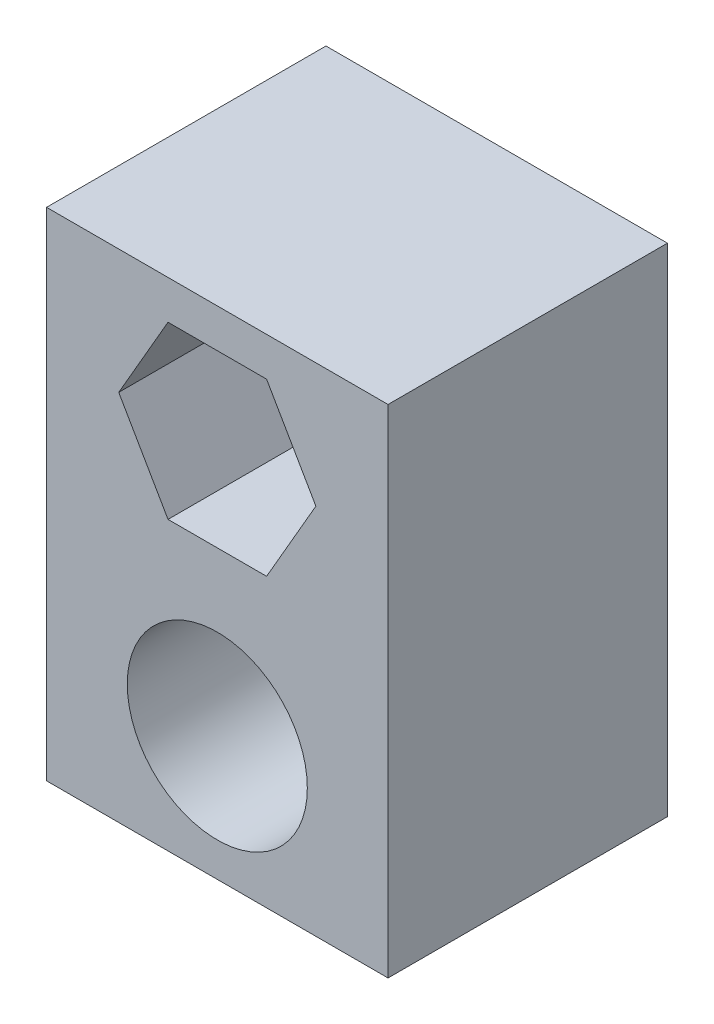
ISO-10303-21;
HEADER;
FILE_DESCRIPTION(('STEP AP214'),'2;1');
FILE_NAME('part.step','',(''),(''),'','','');
FILE_SCHEMA(('AUTOMOTIVE_DESIGN { 1 0 10303 214 1 1 1 1 }'));
ENDSEC;
DATA;
#1=APPLICATION_CONTEXT('core data for automotive mechanical design processes');
#2=APPLICATION_PROTOCOL_DEFINITION('international standard','automotive_design',2000,#1);
#3=PRODUCT_CONTEXT('',#1,'mechanical');
#4=PRODUCT('Part','Part','',(#3));
#5=PRODUCT_RELATED_PRODUCT_CATEGORY('part','',(#4));
#6=PRODUCT_DEFINITION_FORMATION('','',#4);
#7=PRODUCT_DEFINITION_CONTEXT('part definition',#1,'design');
#8=PRODUCT_DEFINITION('design','',#6,#7);
#9=PRODUCT_DEFINITION_SHAPE('','',#8);
#10=(LENGTH_UNIT() NAMED_UNIT(*) SI_UNIT(.MILLI.,.METRE.));
#11=(NAMED_UNIT(*) PLANE_ANGLE_UNIT() SI_UNIT($,.RADIAN.));
#12=(NAMED_UNIT(*) SI_UNIT($,.STERADIAN.) SOLID_ANGLE_UNIT());
#13=UNCERTAINTY_MEASURE_WITH_UNIT(LENGTH_MEASURE(1.E-05),#10,'distance_accuracy_value','');
#14=(GEOMETRIC_REPRESENTATION_CONTEXT(3) GLOBAL_UNCERTAINTY_ASSIGNED_CONTEXT((#13)) GLOBAL_UNIT_ASSIGNED_CONTEXT((#10,
#11,#12)) REPRESENTATION_CONTEXT('',''));
#15=CARTESIAN_POINT('',(0.,0.,0.));
#16=DIRECTION('',(0.,0.,1.));
#17=DIRECTION('',(1.,0.,0.));
#18=AXIS2_PLACEMENT_3D('',#15,#16,#17);
#19=CARTESIAN_POINT('',(0.,0.,9.));
#20=DIRECTION('',(1.,0.,0.));
#21=DIRECTION('',(0.,1.,0.));
#22=AXIS2_PLACEMENT_3D('',#19,#20,#21);
#23=PLANE('',#22);
#24=DIRECTION('',(0.,-1.,0.));
#25=VECTOR('',#24,1.);
#26=CARTESIAN_POINT('',(0.,0.,0.));
#27=LINE('',#26,#25);
#28=CARTESIAN_POINT('',(0.,0.,0.));
#29=VERTEX_POINT('',#28);
#30=CARTESIAN_POINT('',(0.,-16.,0.));
#31=VERTEX_POINT('',#30);
#32=EDGE_CURVE('E179',#29,#31,#27,.T.);
#33=ORIENTED_EDGE('',*,*,#32,.T.);
#34=DIRECTION('',(0.,0.,-1.));
#35=VECTOR('',#34,1.);
#36=CARTESIAN_POINT('',(0.,-16.,9.));
#37=LINE('',#36,#35);
#38=CARTESIAN_POINT('',(0.,-16.,9.));
#39=VERTEX_POINT('',#38);
#40=EDGE_CURVE('E11',#39,#31,#37,.T.);
#41=ORIENTED_EDGE('',*,*,#40,.F.);
#42=DIRECTION('',(0.,-1.,0.));
#43=VECTOR('',#42,1.);
#44=CARTESIAN_POINT('',(0.,0.,9.));
#45=LINE('',#44,#43);
#46=CARTESIAN_POINT('',(0.,0.,9.));
#47=VERTEX_POINT('',#46);
#48=EDGE_CURVE('E192',#47,#39,#45,.T.);
#49=ORIENTED_EDGE('',*,*,#48,.F.);
#50=DIRECTION('',(0.,0.,-1.));
#51=VECTOR('',#50,1.);
#52=CARTESIAN_POINT('',(0.,0.,9.));
#53=LINE('',#52,#51);
#54=EDGE_CURVE('E198',#47,#29,#53,.T.);
#55=ORIENTED_EDGE('',*,*,#54,.T.);
#56=EDGE_LOOP('',(#33,#41,#49,#55));
#57=FACE_BOUND('',#56,.T.);
#58=ADVANCED_FACE('F41',(#57),#23,.F.);
#59=CARTESIAN_POINT('',(0.,-16.,9.));
#60=DIRECTION('',(0.,1.,0.));
#61=DIRECTION('',(0.,0.,1.));
#62=AXIS2_PLACEMENT_3D('',#59,#60,#61);
#63=PLANE('',#62);
#64=DIRECTION('',(1.,0.,0.));
#65=VECTOR('',#64,1.);
#66=CARTESIAN_POINT('',(0.,-16.,0.));
#67=LINE('',#66,#65);
#68=CARTESIAN_POINT('',(11.,-16.,0.));
#69=VERTEX_POINT('',#68);
#70=EDGE_CURVE('E201',#31,#69,#67,.T.);
#71=ORIENTED_EDGE('',*,*,#70,.T.);
#72=DIRECTION('',(0.,0.,-1.));
#73=VECTOR('',#72,1.);
#74=CARTESIAN_POINT('',(11.,-16.,9.));
#75=LINE('',#74,#73);
#76=CARTESIAN_POINT('',(11.,-16.,9.));
#77=VERTEX_POINT('',#76);
#78=EDGE_CURVE('E49',#77,#69,#75,.T.);
#79=ORIENTED_EDGE('',*,*,#78,.F.);
#80=DIRECTION('',(1.,0.,0.));
#81=VECTOR('',#80,1.);
#82=CARTESIAN_POINT('',(0.,-16.,9.));
#83=LINE('',#82,#81);
#84=EDGE_CURVE('E94',#39,#77,#83,.T.);
#85=ORIENTED_EDGE('',*,*,#84,.F.);
#86=ORIENTED_EDGE('',*,*,#40,.T.);
#87=EDGE_LOOP('',(#71,#79,#85,#86));
#88=FACE_BOUND('',#87,.T.);
#89=ADVANCED_FACE('F238',(#88),#63,.F.);
#90=CARTESIAN_POINT('',(11.,0.,9.));
#91=DIRECTION('',(-1.,0.,0.));
#92=DIRECTION('',(0.,-1.,0.));
#93=AXIS2_PLACEMENT_3D('',#90,#91,#92);
#94=PLANE('',#93);
#95=DIRECTION('',(0.,1.,0.));
#96=VECTOR('',#95,1.);
#97=CARTESIAN_POINT('',(11.,0.,0.));
#98=LINE('',#97,#96);
#99=CARTESIAN_POINT('',(11.,0.,0.));
#100=VERTEX_POINT('',#99);
#101=EDGE_CURVE('E203',#69,#100,#98,.T.);
#102=ORIENTED_EDGE('',*,*,#101,.T.);
#103=DIRECTION('',(0.,0.,-1.));
#104=VECTOR('',#103,1.);
#105=CARTESIAN_POINT('',(11.,0.,9.));
#106=LINE('',#105,#104);
#107=CARTESIAN_POINT('',(11.,0.,9.));
#108=VERTEX_POINT('',#107);
#109=EDGE_CURVE('E207',#108,#100,#106,.T.);
#110=ORIENTED_EDGE('',*,*,#109,.F.);
#111=DIRECTION('',(0.,1.,0.));
#112=VECTOR('',#111,1.);
#113=CARTESIAN_POINT('',(11.,0.,9.));
#114=LINE('',#113,#112);
#115=EDGE_CURVE('E195',#77,#108,#114,.T.);
#116=ORIENTED_EDGE('',*,*,#115,.F.);
#117=ORIENTED_EDGE('',*,*,#78,.T.);
#118=EDGE_LOOP('',(#102,#110,#116,#117));
#119=FACE_BOUND('',#118,.T.);
#120=ADVANCED_FACE('F243',(#119),#94,.F.);
#121=CARTESIAN_POINT('',(0.,0.,9.));
#122=DIRECTION('',(0.,-1.,0.));
#123=DIRECTION('',(0.,0.,-1.));
#124=AXIS2_PLACEMENT_3D('',#121,#122,#123);
#125=PLANE('',#124);
#126=DIRECTION('',(-1.,0.,0.));
#127=VECTOR('',#126,1.);
#128=CARTESIAN_POINT('',(0.,0.,0.));
#129=LINE('',#128,#127);
#130=EDGE_CURVE('E87',#100,#29,#129,.T.);
#131=ORIENTED_EDGE('',*,*,#130,.T.);
#132=ORIENTED_EDGE('',*,*,#54,.F.);
#133=DIRECTION('',(-1.,0.,0.));
#134=VECTOR('',#133,1.);
#135=CARTESIAN_POINT('',(0.,0.,9.));
#136=LINE('',#135,#134);
#137=EDGE_CURVE('E66',#108,#47,#136,.T.);
#138=ORIENTED_EDGE('',*,*,#137,.F.);
#139=ORIENTED_EDGE('',*,*,#109,.T.);
#140=EDGE_LOOP('',(#131,#132,#138,#139));
#141=FACE_BOUND('',#140,.T.);
#142=ADVANCED_FACE('F253',(#141),#125,.F.);
#143=CARTESIAN_POINT('',(0.,0.,9.));
#144=DIRECTION('',(0.,0.,1.));
#145=DIRECTION('',(1.,0.,0.));
#146=AXIS2_PLACEMENT_3D('',#143,#144,#145);
#147=PLANE('',#146);
#148=DIRECTION('',(0.5,0.866025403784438,0.));
#149=VECTOR('',#148,1.);
#150=CARTESIAN_POINT('',(7.08771324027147,-6.74999999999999,9.));
#151=LINE('',#150,#149);
#152=CARTESIAN_POINT('',(7.08771324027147,-6.74999999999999,9.));
#153=VERTEX_POINT('',#152);
#154=CARTESIAN_POINT('',(8.67542648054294,-4.,9.));
#155=VERTEX_POINT('',#154);
#156=EDGE_CURVE('E57',#153,#155,#151,.T.);
#157=ORIENTED_EDGE('',*,*,#156,.F.);
#158=DIRECTION('',(1.,0.,0.));
#159=VECTOR('',#158,1.);
#160=CARTESIAN_POINT('',(3.91228675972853,-6.75,9.));
#161=LINE('',#160,#159);
#162=CARTESIAN_POINT('',(3.91228675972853,-6.75,9.));
#163=VERTEX_POINT('',#162);
#164=EDGE_CURVE('E149',#163,#153,#161,.T.);
#165=ORIENTED_EDGE('',*,*,#164,.F.);
#166=DIRECTION('',(0.5,-0.866025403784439,0.));
#167=VECTOR('',#166,1.);
#168=CARTESIAN_POINT('',(2.32457351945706,-4.,9.));
#169=LINE('',#168,#167);
#170=CARTESIAN_POINT('',(2.32457351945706,-4.,9.));
#171=VERTEX_POINT('',#170);
#172=EDGE_CURVE('E152',#171,#163,#169,.T.);
#173=ORIENTED_EDGE('',*,*,#172,.F.);
#174=DIRECTION('',(-0.5,-0.866025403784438,0.));
#175=VECTOR('',#174,1.);
#176=CARTESIAN_POINT('',(3.91228675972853,-1.25,9.));
#177=LINE('',#176,#175);
#178=CARTESIAN_POINT('',(3.91228675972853,-1.25,9.));
#179=VERTEX_POINT('',#178);
#180=EDGE_CURVE('E172',#179,#171,#177,.T.);
#181=ORIENTED_EDGE('',*,*,#180,.F.);
#182=DIRECTION('',(-1.,0.,0.));
#183=VECTOR('',#182,1.);
#184=CARTESIAN_POINT('',(7.08771324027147,-1.25,9.));
#185=LINE('',#184,#183);
#186=CARTESIAN_POINT('',(7.08771324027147,-1.25,9.));
#187=VERTEX_POINT('',#186);
#188=EDGE_CURVE('E169',#187,#179,#185,.T.);
#189=ORIENTED_EDGE('',*,*,#188,.F.);
#190=DIRECTION('',(-0.5,0.866025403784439,0.));
#191=VECTOR('',#190,1.);
#192=CARTESIAN_POINT('',(8.67542648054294,-4.,9.));
#193=LINE('',#192,#191);
#194=EDGE_CURVE('E166',#155,#187,#193,.T.);
#195=ORIENTED_EDGE('',*,*,#194,.F.);
#196=EDGE_LOOP('',(#157,#165,#173,#181,#189,#195));
#197=FACE_BOUND('',#196,.T.);
#198=CARTESIAN_POINT('',(5.5,-12.,9.));
#199=DIRECTION('',(0.,0.,1.));
#200=DIRECTION('',(1.,0.,0.));
#201=AXIS2_PLACEMENT_3D('',#198,#199,#200);
#202=CIRCLE('',#201,2.9);
#203=CARTESIAN_POINT('',(8.4,-12.,9.));
#204=VERTEX_POINT('',#203);
#205=EDGE_CURVE('E167',#204,#204,#202,.T.);
#206=ORIENTED_EDGE('',*,*,#205,.F.);
#207=EDGE_LOOP('',(#206));
#208=FACE_BOUND('',#207,.T.);
#209=ORIENTED_EDGE('',*,*,#48,.T.);
#210=ORIENTED_EDGE('',*,*,#84,.T.);
#211=ORIENTED_EDGE('',*,*,#115,.T.);
#212=ORIENTED_EDGE('',*,*,#137,.T.);
#213=EDGE_LOOP('',(#209,#210,#211,#212));
#214=FACE_BOUND('',#213,.T.);
#215=ADVANCED_FACE('F251',(#197,#208,#214),#147,.T.);
#216=CARTESIAN_POINT('',(0.,0.,0.));
#217=DIRECTION('',(0.,0.,1.));
#218=DIRECTION('',(1.,0.,0.));
#219=AXIS2_PLACEMENT_3D('',#216,#217,#218);
#220=PLANE('',#219);
#221=CARTESIAN_POINT('',(5.5,-12.,0.));
#222=DIRECTION('',(0.,0.,1.));
#223=DIRECTION('',(1.,0.,0.));
#224=AXIS2_PLACEMENT_3D('',#221,#222,#223);
#225=CIRCLE('',#224,1.6);
#226=CARTESIAN_POINT('',(7.1,-12.,0.));
#227=VERTEX_POINT('',#226);
#228=EDGE_CURVE('E212',#227,#227,#225,.T.);
#229=ORIENTED_EDGE('',*,*,#228,.T.);
#230=EDGE_LOOP('',(#229));
#231=FACE_BOUND('',#230,.T.);
#232=CARTESIAN_POINT('',(5.49999999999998,-4.,0.));
#233=DIRECTION('',(0.,0.,1.));
#234=DIRECTION('',(1.,0.,0.));
#235=AXIS2_PLACEMENT_3D('',#232,#233,#234);
#236=CIRCLE('',#235,1.6);
#237=CARTESIAN_POINT('',(7.09999999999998,-4.,0.));
#238=VERTEX_POINT('',#237);
#239=EDGE_CURVE('E155',#238,#238,#236,.T.);
#240=ORIENTED_EDGE('',*,*,#239,.T.);
#241=EDGE_LOOP('',(#240));
#242=FACE_BOUND('',#241,.T.);
#243=ORIENTED_EDGE('',*,*,#32,.F.);
#244=ORIENTED_EDGE('',*,*,#130,.F.);
#245=ORIENTED_EDGE('',*,*,#101,.F.);
#246=ORIENTED_EDGE('',*,*,#70,.F.);
#247=EDGE_LOOP('',(#243,#244,#245,#246));
#248=FACE_BOUND('',#247,.T.);
#249=ADVANCED_FACE('F222',(#231,#242,#248),#220,.F.);
#250=CARTESIAN_POINT('',(5.5,-12.,4.));
#251=DIRECTION('',(0.,0.,1.));
#252=DIRECTION('',(1.,0.,0.));
#253=AXIS2_PLACEMENT_3D('',#250,#251,#252);
#254=CYLINDRICAL_SURFACE('',#253,2.9);
#255=CARTESIAN_POINT('',(5.5,-12.,4.));
#256=DIRECTION('',(0.,0.,1.));
#257=DIRECTION('',(1.,0.,0.));
#258=AXIS2_PLACEMENT_3D('',#255,#256,#257);
#259=CIRCLE('',#258,2.9);
#260=CARTESIAN_POINT('',(8.4,-12.,4.));
#261=VERTEX_POINT('',#260);
#262=EDGE_CURVE('E189',#261,#261,#259,.T.);
#263=ORIENTED_EDGE('',*,*,#262,.F.);
#264=EDGE_LOOP('',(#263));
#265=FACE_BOUND('',#264,.T.);
#266=ORIENTED_EDGE('',*,*,#205,.T.);
#267=EDGE_LOOP('',(#266));
#268=FACE_BOUND('',#267,.T.);
#269=ADVANCED_FACE('F261',(#265,#268),#254,.F.);
#270=CARTESIAN_POINT('',(5.5,-12.,4.));
#271=DIRECTION('',(0.,0.,1.));
#272=DIRECTION('',(1.,0.,0.));
#273=AXIS2_PLACEMENT_3D('',#270,#271,#272);
#274=PLANE('',#273);
#275=CARTESIAN_POINT('',(5.5,-12.,4.));
#276=DIRECTION('',(0.,0.,1.));
#277=DIRECTION('',(1.,0.,0.));
#278=AXIS2_PLACEMENT_3D('',#275,#276,#277);
#279=CIRCLE('',#278,1.6);
#280=CARTESIAN_POINT('',(7.1,-12.,4.));
#281=VERTEX_POINT('',#280);
#282=EDGE_CURVE('E44',#281,#281,#279,.T.);
#283=ORIENTED_EDGE('',*,*,#282,.F.);
#284=EDGE_LOOP('',(#283));
#285=FACE_BOUND('',#284,.T.);
#286=ORIENTED_EDGE('',*,*,#262,.T.);
#287=EDGE_LOOP('',(#286));
#288=FACE_BOUND('',#287,.T.);
#289=ADVANCED_FACE('F266',(#285,#288),#274,.T.);
#290=CARTESIAN_POINT('',(7.08771324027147,-6.74999999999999,4.));
#291=DIRECTION('',(0.866025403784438,-0.5,0.));
#292=DIRECTION('',(0.5,0.866025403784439,0.));
#293=AXIS2_PLACEMENT_3D('',#290,#291,#292);
#294=PLANE('',#293);
#295=ORIENTED_EDGE('',*,*,#156,.T.);
#296=DIRECTION('',(0.,0.,1.));
#297=VECTOR('',#296,1.);
#298=CARTESIAN_POINT('',(8.67542648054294,-4.,4.));
#299=LINE('',#298,#297);
#300=CARTESIAN_POINT('',(8.67542648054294,-4.,4.));
#301=VERTEX_POINT('',#300);
#302=EDGE_CURVE('E126',#301,#155,#299,.T.);
#303=ORIENTED_EDGE('',*,*,#302,.F.);
#304=DIRECTION('',(0.5,0.866025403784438,0.));
#305=VECTOR('',#304,1.);
#306=CARTESIAN_POINT('',(7.08771324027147,-6.74999999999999,4.));
#307=LINE('',#306,#305);
#308=CARTESIAN_POINT('',(7.08771324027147,-6.74999999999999,4.));
#309=VERTEX_POINT('',#308);
#310=EDGE_CURVE('E130',#309,#301,#307,.T.);
#311=ORIENTED_EDGE('',*,*,#310,.F.);
#312=DIRECTION('',(0.,0.,1.));
#313=VECTOR('',#312,1.);
#314=CARTESIAN_POINT('',(7.08771324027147,-6.74999999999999,4.));
#315=LINE('',#314,#313);
#316=EDGE_CURVE('E177',#309,#153,#315,.T.);
#317=ORIENTED_EDGE('',*,*,#316,.T.);
#318=EDGE_LOOP('',(#295,#303,#311,#317));
#319=FACE_BOUND('',#318,.T.);
#320=ADVANCED_FACE('F128',(#319),#294,.F.);
#321=CARTESIAN_POINT('',(3.91228675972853,-6.75,4.));
#322=DIRECTION('',(0.,-1.,0.));
#323=DIRECTION('',(1.,0.,0.));
#324=AXIS2_PLACEMENT_3D('',#321,#322,#323);
#325=PLANE('',#324);
#326=ORIENTED_EDGE('',*,*,#164,.T.);
#327=ORIENTED_EDGE('',*,*,#316,.F.);
#328=DIRECTION('',(1.,0.,0.));
#329=VECTOR('',#328,1.);
#330=CARTESIAN_POINT('',(3.91228675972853,-6.75,4.));
#331=LINE('',#330,#329);
#332=CARTESIAN_POINT('',(3.91228675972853,-6.75,4.));
#333=VERTEX_POINT('',#332);
#334=EDGE_CURVE('E136',#333,#309,#331,.T.);
#335=ORIENTED_EDGE('',*,*,#334,.F.);
#336=DIRECTION('',(0.,0.,1.));
#337=VECTOR('',#336,1.);
#338=CARTESIAN_POINT('',(3.91228675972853,-6.75,4.));
#339=LINE('',#338,#337);
#340=EDGE_CURVE('E180',#333,#163,#339,.T.);
#341=ORIENTED_EDGE('',*,*,#340,.T.);
#342=EDGE_LOOP('',(#326,#327,#335,#341));
#343=FACE_BOUND('',#342,.T.);
#344=ADVANCED_FACE('F315',(#343),#325,.F.);
#345=CARTESIAN_POINT('',(2.32457351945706,-4.,4.));
#346=DIRECTION('',(-0.866025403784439,-0.5,0.));
#347=DIRECTION('',(0.5,-0.866025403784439,0.));
#348=AXIS2_PLACEMENT_3D('',#345,#346,#347);
#349=PLANE('',#348);
#350=ORIENTED_EDGE('',*,*,#172,.T.);
#351=ORIENTED_EDGE('',*,*,#340,.F.);
#352=DIRECTION('',(0.5,-0.866025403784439,0.));
#353=VECTOR('',#352,1.);
#354=CARTESIAN_POINT('',(2.32457351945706,-4.,4.));
#355=LINE('',#354,#353);
#356=CARTESIAN_POINT('',(2.32457351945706,-4.,4.));
#357=VERTEX_POINT('',#356);
#358=EDGE_CURVE('E162',#357,#333,#355,.T.);
#359=ORIENTED_EDGE('',*,*,#358,.F.);
#360=DIRECTION('',(0.,0.,1.));
#361=VECTOR('',#360,1.);
#362=CARTESIAN_POINT('',(2.32457351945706,-4.,4.));
#363=LINE('',#362,#361);
#364=EDGE_CURVE('E182',#357,#171,#363,.T.);
#365=ORIENTED_EDGE('',*,*,#364,.T.);
#366=EDGE_LOOP('',(#350,#351,#359,#365));
#367=FACE_BOUND('',#366,.T.);
#368=ADVANCED_FACE('F324',(#367),#349,.F.);
#369=CARTESIAN_POINT('',(3.91228675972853,-1.25,4.));
#370=DIRECTION('',(-0.866025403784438,0.5,0.));
#371=DIRECTION('',(-0.5,-0.866025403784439,0.));
#372=AXIS2_PLACEMENT_3D('',#369,#370,#371);
#373=PLANE('',#372);
#374=ORIENTED_EDGE('',*,*,#180,.T.);
#375=ORIENTED_EDGE('',*,*,#364,.F.);
#376=DIRECTION('',(-0.5,-0.866025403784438,0.));
#377=VECTOR('',#376,1.);
#378=CARTESIAN_POINT('',(3.91228675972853,-1.25,4.));
#379=LINE('',#378,#377);
#380=CARTESIAN_POINT('',(3.91228675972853,-1.25,4.));
#381=VERTEX_POINT('',#380);
#382=EDGE_CURVE('E159',#381,#357,#379,.T.);
#383=ORIENTED_EDGE('',*,*,#382,.F.);
#384=DIRECTION('',(0.,0.,1.));
#385=VECTOR('',#384,1.);
#386=CARTESIAN_POINT('',(3.91228675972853,-1.25,4.));
#387=LINE('',#386,#385);
#388=EDGE_CURVE('E184',#381,#179,#387,.T.);
#389=ORIENTED_EDGE('',*,*,#388,.T.);
#390=EDGE_LOOP('',(#374,#375,#383,#389));
#391=FACE_BOUND('',#390,.T.);
#392=ADVANCED_FACE('F334',(#391),#373,.F.);
#393=CARTESIAN_POINT('',(7.08771324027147,-1.25,4.));
#394=DIRECTION('',(0.,1.,0.));
#395=DIRECTION('',(0.,0.,1.));
#396=AXIS2_PLACEMENT_3D('',#393,#394,#395);
#397=PLANE('',#396);
#398=ORIENTED_EDGE('',*,*,#188,.T.);
#399=ORIENTED_EDGE('',*,*,#388,.F.);
#400=DIRECTION('',(-1.,0.,0.));
#401=VECTOR('',#400,1.);
#402=CARTESIAN_POINT('',(7.08771324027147,-1.25,4.));
#403=LINE('',#402,#401);
#404=CARTESIAN_POINT('',(7.08771324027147,-1.25,4.));
#405=VERTEX_POINT('',#404);
#406=EDGE_CURVE('E144',#405,#381,#403,.T.);
#407=ORIENTED_EDGE('',*,*,#406,.F.);
#408=DIRECTION('',(0.,0.,1.));
#409=VECTOR('',#408,1.);
#410=CARTESIAN_POINT('',(7.08771324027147,-1.25,4.));
#411=LINE('',#410,#409);
#412=EDGE_CURVE('E135',#405,#187,#411,.T.);
#413=ORIENTED_EDGE('',*,*,#412,.T.);
#414=EDGE_LOOP('',(#398,#399,#407,#413));
#415=FACE_BOUND('',#414,.T.);
#416=ADVANCED_FACE('F344',(#415),#397,.F.);
#417=CARTESIAN_POINT('',(8.67542648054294,-4.,4.));
#418=DIRECTION('',(0.866025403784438,0.5,0.));
#419=DIRECTION('',(-0.5,0.866025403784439,0.));
#420=AXIS2_PLACEMENT_3D('',#417,#418,#419);
#421=PLANE('',#420);
#422=ORIENTED_EDGE('',*,*,#194,.T.);
#423=ORIENTED_EDGE('',*,*,#412,.F.);
#424=DIRECTION('',(-0.5,0.866025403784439,0.));
#425=VECTOR('',#424,1.);
#426=CARTESIAN_POINT('',(8.67542648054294,-4.,4.));
#427=LINE('',#426,#425);
#428=EDGE_CURVE('E139',#301,#405,#427,.T.);
#429=ORIENTED_EDGE('',*,*,#428,.F.);
#430=ORIENTED_EDGE('',*,*,#302,.T.);
#431=EDGE_LOOP('',(#422,#423,#429,#430));
#432=FACE_BOUND('',#431,.T.);
#433=ADVANCED_FACE('F140',(#432),#421,.F.);
#434=CARTESIAN_POINT('',(0.,0.,4.));
#435=DIRECTION('',(0.,0.,1.));
#436=DIRECTION('',(1.,0.,0.));
#437=AXIS2_PLACEMENT_3D('',#434,#435,#436);
#438=PLANE('',#437);
#439=CARTESIAN_POINT('',(5.49999999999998,-4.,4.));
#440=DIRECTION('',(0.,0.,1.));
#441=DIRECTION('',(1.,0.,0.));
#442=AXIS2_PLACEMENT_3D('',#439,#440,#441);
#443=CIRCLE('',#442,1.6);
#444=CARTESIAN_POINT('',(7.09999999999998,-4.,4.));
#445=VERTEX_POINT('',#444);
#446=EDGE_CURVE('E210',#445,#445,#443,.T.);
#447=ORIENTED_EDGE('',*,*,#446,.F.);
#448=EDGE_LOOP('',(#447));
#449=FACE_BOUND('',#448,.T.);
#450=ORIENTED_EDGE('',*,*,#310,.T.);
#451=ORIENTED_EDGE('',*,*,#428,.T.);
#452=ORIENTED_EDGE('',*,*,#406,.T.);
#453=ORIENTED_EDGE('',*,*,#382,.T.);
#454=ORIENTED_EDGE('',*,*,#358,.T.);
#455=ORIENTED_EDGE('',*,*,#334,.T.);
#456=EDGE_LOOP('',(#450,#451,#452,#453,#454,#455));
#457=FACE_BOUND('',#456,.T.);
#458=ADVANCED_FACE('F146',(#449,#457),#438,.T.);
#459=CARTESIAN_POINT('',(5.49999999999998,-4.,0.));
#460=DIRECTION('',(0.,0.,1.));
#461=DIRECTION('',(1.,0.,0.));
#462=AXIS2_PLACEMENT_3D('',#459,#460,#461);
#463=CYLINDRICAL_SURFACE('',#462,1.6);
#464=ORIENTED_EDGE('',*,*,#446,.T.);
#465=EDGE_LOOP('',(#464));
#466=FACE_BOUND('',#465,.T.);
#467=ORIENTED_EDGE('',*,*,#239,.F.);
#468=EDGE_LOOP('',(#467));
#469=FACE_BOUND('',#468,.T.);
#470=ADVANCED_FACE('F225',(#466,#469),#463,.F.);
#471=CARTESIAN_POINT('',(5.5,-12.,0.));
#472=DIRECTION('',(0.,0.,1.));
#473=DIRECTION('',(1.,0.,0.));
#474=AXIS2_PLACEMENT_3D('',#471,#472,#473);
#475=CYLINDRICAL_SURFACE('',#474,1.6);
#476=ORIENTED_EDGE('',*,*,#282,.T.);
#477=EDGE_LOOP('',(#476));
#478=FACE_BOUND('',#477,.T.);
#479=ORIENTED_EDGE('',*,*,#228,.F.);
#480=EDGE_LOOP('',(#479));
#481=FACE_BOUND('',#480,.T.);
#482=ADVANCED_FACE('F227',(#478,#481),#475,.F.);
#483=CLOSED_SHELL('',(#58,#89,#120,#142,#215,#249,#269,#289,#320,#344,#368,#392,#416,#433,#458,
#470,#482));
#484=MANIFOLD_SOLID_BREP('B2',#483);
#485=ADVANCED_BREP_SHAPE_REPRESENTATION('',(#18,#484),#14);
#486=SHAPE_DEFINITION_REPRESENTATION(#9,#485);
ENDSEC;
END-ISO-10303-21;
